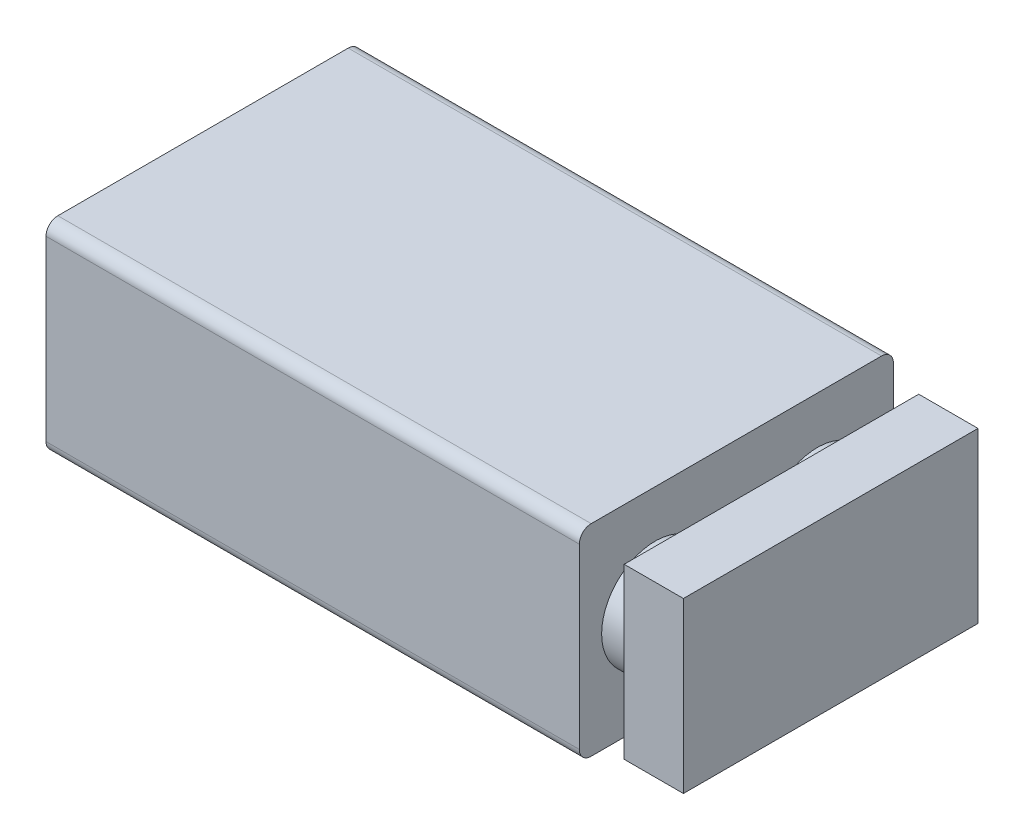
from build123d import *

# Parameters (mm, degrees)
ESQUISSE1_W        = 45
ESQUISSE1_H        = 17
BOSS_EXTRU_1_DEPTH = 26.5
ESQUISSE2_R        = 4.522983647
BOSS_EXTRU_2_DEPTH = 3
CONG_1_R           = 1
ESQUISSE3_W        = 24.85635423
ESQUISSE3_H        = 14.252739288
BOSS_EXTRU_3_DEPTH = 5


with BuildPart() as part:
    # Esquisse1 → Boss.-Extru.1 (new body)
    with BuildSketch(Plane.XY):
        with Locations((22.5, 8.5)):
            Rectangle(ESQUISSE1_W, ESQUISSE1_H)
    extrude(amount=BOSS_EXTRU_1_DEPTH)

    # Esquisse2 → Boss.-Extru.2 (add)
    with BuildSketch(Plane(origin=(45, 0, 0), x_dir=(0, 0, -1), z_dir=(1, 0, 0))):
        with Locations(Location((-20.095007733, 8.5, 0), (0, 0, 180))):
            Circle(ESQUISSE2_R)
        with Locations(Location((-6.404992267, 8.5, 0), (0, 0, 180))):
            Circle(ESQUISSE2_R)
    extrude(amount=BOSS_EXTRU_2_DEPTH)

    # Cong_1
    cong_1_edges = [part.edges().sort_by_distance(p)[0] for p in [
        (22.5, 17, 26.5),
        (22.5, 17, 0),
        (22.5, 0, 0),
        (22.5, 0, 26.5),
    ]]
    fillet(cong_1_edges, radius=CONG_1_R)

    # Esquisse3 → Boss.-Extru.3 (add)
    with BuildSketch(Plane(origin=(48, 0, 0), x_dir=(0, 0, -1), z_dir=(1, 0, 0))):
        with Locations((-13.289664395, 8.513221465)):
            Rectangle(ESQUISSE3_W, ESQUISSE3_H)
    extrude(amount=BOSS_EXTRU_3_DEPTH)


solid = part.part
